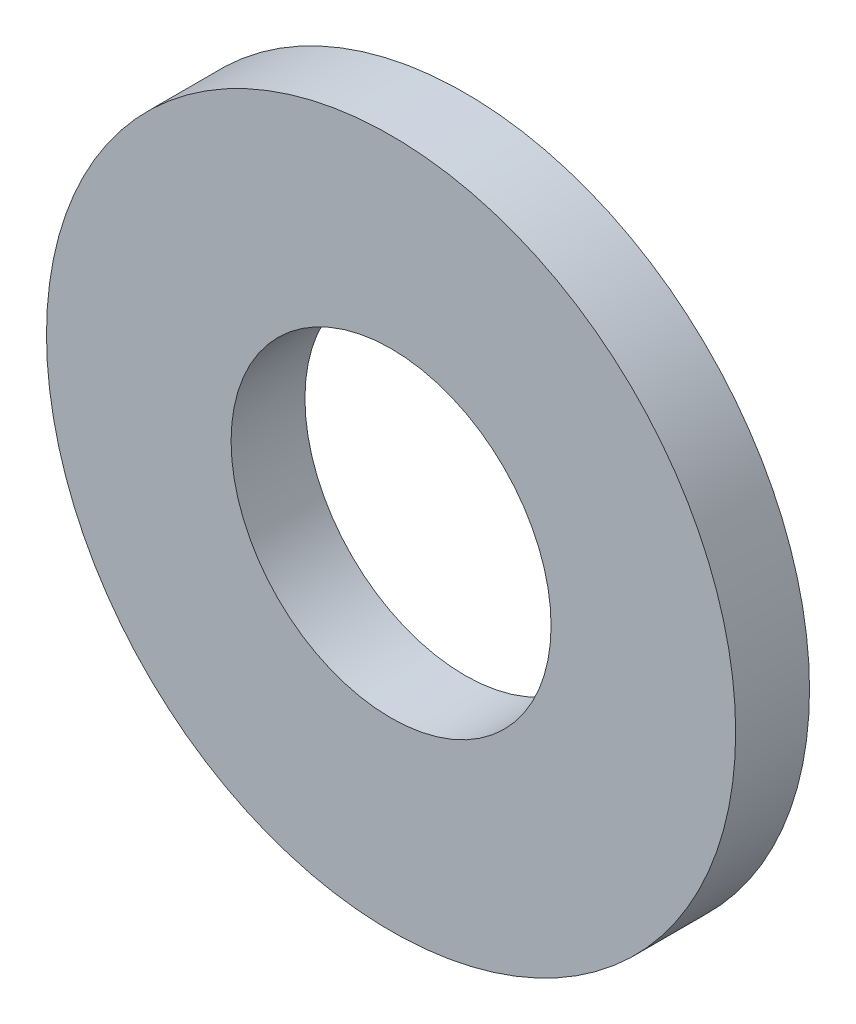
ISO-10303-21;
HEADER;
FILE_DESCRIPTION(('STEP AP214'),'2;1');
FILE_NAME('part.step','',(''),(''),'','','');
FILE_SCHEMA(('AUTOMOTIVE_DESIGN { 1 0 10303 214 1 1 1 1 }'));
ENDSEC;
DATA;
#1=APPLICATION_CONTEXT('core data for automotive mechanical design processes');
#2=APPLICATION_PROTOCOL_DEFINITION('international standard','automotive_design',2000,#1);
#3=PRODUCT_CONTEXT('',#1,'mechanical');
#4=PRODUCT('Part','Part','',(#3));
#5=PRODUCT_RELATED_PRODUCT_CATEGORY('part','',(#4));
#6=PRODUCT_DEFINITION_FORMATION('','',#4);
#7=PRODUCT_DEFINITION_CONTEXT('part definition',#1,'design');
#8=PRODUCT_DEFINITION('design','',#6,#7);
#9=PRODUCT_DEFINITION_SHAPE('','',#8);
#10=(LENGTH_UNIT() NAMED_UNIT(*) SI_UNIT(.MILLI.,.METRE.));
#11=(NAMED_UNIT(*) PLANE_ANGLE_UNIT() SI_UNIT($,.RADIAN.));
#12=(NAMED_UNIT(*) SI_UNIT($,.STERADIAN.) SOLID_ANGLE_UNIT());
#13=UNCERTAINTY_MEASURE_WITH_UNIT(LENGTH_MEASURE(1.E-05),#10,'distance_accuracy_value','');
#14=(GEOMETRIC_REPRESENTATION_CONTEXT(3) GLOBAL_UNCERTAINTY_ASSIGNED_CONTEXT((#13)) GLOBAL_UNIT_ASSIGNED_CONTEXT((#10,
#11,#12)) REPRESENTATION_CONTEXT('',''));
#15=CARTESIAN_POINT('',(0.,0.,0.));
#16=DIRECTION('',(0.,0.,1.));
#17=DIRECTION('',(1.,0.,0.));
#18=AXIS2_PLACEMENT_3D('',#15,#16,#17);
#19=CARTESIAN_POINT('',(0.,0.,1.5));
#20=DIRECTION('',(0.,0.,1.));
#21=DIRECTION('',(1.,0.,0.));
#22=AXIS2_PLACEMENT_3D('',#19,#20,#21);
#23=PLANE('',#22);
#24=CARTESIAN_POINT('',(0.,0.,1.5));
#25=DIRECTION('',(0.,0.,1.));
#26=DIRECTION('',(1.,0.,0.));
#27=AXIS2_PLACEMENT_3D('',#24,#25,#26);
#28=CIRCLE('',#27,7.);
#29=CARTESIAN_POINT('',(7.,0.,1.5));
#30=VERTEX_POINT('',#29);
#31=EDGE_CURVE('E10',#30,#30,#28,.T.);
#32=ORIENTED_EDGE('',*,*,#31,.T.);
#33=EDGE_LOOP('',(#32));
#34=FACE_BOUND('',#33,.T.);
#35=CARTESIAN_POINT('',(0.,0.,1.5));
#36=DIRECTION('',(0.,0.,1.));
#37=DIRECTION('',(1.,0.,0.));
#38=AXIS2_PLACEMENT_3D('',#35,#36,#37);
#39=CIRCLE('',#38,3.25);
#40=CARTESIAN_POINT('',(3.25,0.,1.5));
#41=VERTEX_POINT('',#40);
#42=EDGE_CURVE('E27',#41,#41,#39,.T.);
#43=ORIENTED_EDGE('',*,*,#42,.F.);
#44=EDGE_LOOP('',(#43));
#45=FACE_BOUND('',#44,.T.);
#46=ADVANCED_FACE('F16',(#34,#45),#23,.T.);
#47=CARTESIAN_POINT('',(0.,0.,0.));
#48=DIRECTION('',(0.,0.,1.));
#49=DIRECTION('',(1.,0.,0.));
#50=AXIS2_PLACEMENT_3D('',#47,#48,#49);
#51=PLANE('',#50);
#52=CARTESIAN_POINT('',(0.,0.,0.));
#53=DIRECTION('',(0.,0.,1.));
#54=DIRECTION('',(1.,0.,0.));
#55=AXIS2_PLACEMENT_3D('',#52,#53,#54);
#56=CIRCLE('',#55,7.);
#57=CARTESIAN_POINT('',(7.,0.,0.));
#58=VERTEX_POINT('',#57);
#59=EDGE_CURVE('E20',#58,#58,#56,.T.);
#60=ORIENTED_EDGE('',*,*,#59,.F.);
#61=EDGE_LOOP('',(#60));
#62=FACE_BOUND('',#61,.T.);
#63=CARTESIAN_POINT('',(0.,0.,0.));
#64=DIRECTION('',(0.,0.,1.));
#65=DIRECTION('',(1.,0.,0.));
#66=AXIS2_PLACEMENT_3D('',#63,#64,#65);
#67=CIRCLE('',#66,3.25);
#68=CARTESIAN_POINT('',(3.25,0.,0.));
#69=VERTEX_POINT('',#68);
#70=EDGE_CURVE('E29',#69,#69,#67,.T.);
#71=ORIENTED_EDGE('',*,*,#70,.T.);
#72=EDGE_LOOP('',(#71));
#73=FACE_BOUND('',#72,.T.);
#74=ADVANCED_FACE('F39',(#62,#73),#51,.F.);
#75=CARTESIAN_POINT('',(0.,0.,1.5));
#76=DIRECTION('',(0.,0.,-1.));
#77=DIRECTION('',(-1.,0.,0.));
#78=AXIS2_PLACEMENT_3D('',#75,#76,#77);
#79=CYLINDRICAL_SURFACE('',#78,7.);
#80=ORIENTED_EDGE('',*,*,#31,.F.);
#81=EDGE_LOOP('',(#80));
#82=FACE_BOUND('',#81,.T.);
#83=ORIENTED_EDGE('',*,*,#59,.T.);
#84=EDGE_LOOP('',(#83));
#85=FACE_BOUND('',#84,.T.);
#86=ADVANCED_FACE('F18',(#82,#85),#79,.T.);
#87=CARTESIAN_POINT('',(0.,0.,1.5));
#88=DIRECTION('',(0.,0.,-1.));
#89=DIRECTION('',(-1.,0.,0.));
#90=AXIS2_PLACEMENT_3D('',#87,#88,#89);
#91=CYLINDRICAL_SURFACE('',#90,3.25);
#92=ORIENTED_EDGE('',*,*,#42,.T.);
#93=EDGE_LOOP('',(#92));
#94=FACE_BOUND('',#93,.T.);
#95=ORIENTED_EDGE('',*,*,#70,.F.);
#96=EDGE_LOOP('',(#95));
#97=FACE_BOUND('',#96,.T.);
#98=ADVANCED_FACE('F35',(#94,#97),#91,.F.);
#99=CLOSED_SHELL('',(#46,#74,#86,#98));
#100=MANIFOLD_SOLID_BREP('B1',#99);
#101=ADVANCED_BREP_SHAPE_REPRESENTATION('',(#18,#100),#14);
#102=SHAPE_DEFINITION_REPRESENTATION(#9,#101);
ENDSEC;
END-ISO-10303-21;
